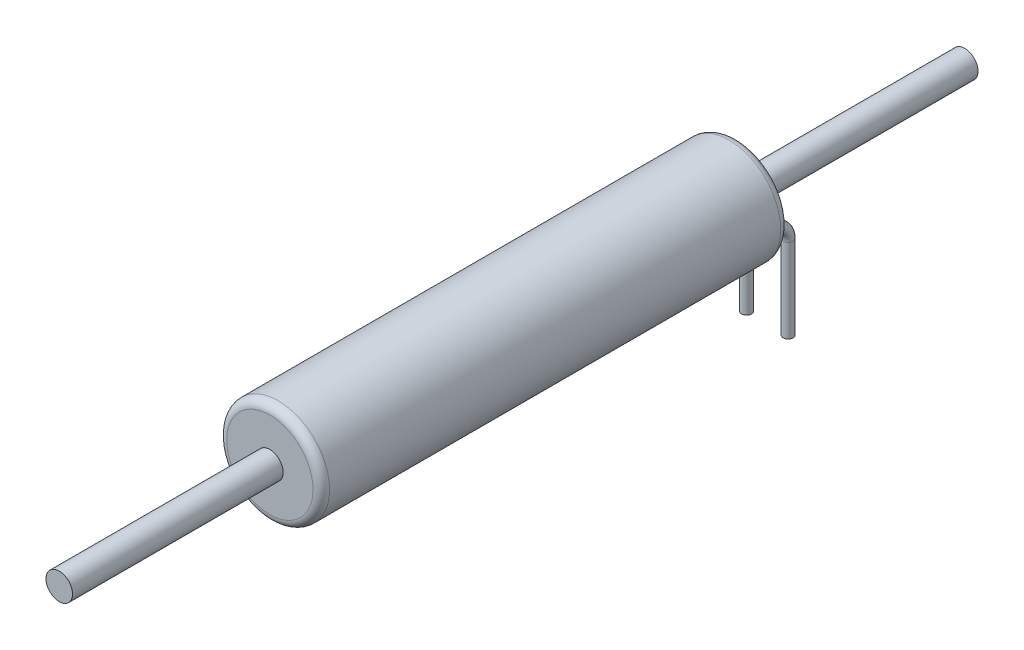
ISO-10303-21;
HEADER;
FILE_DESCRIPTION(('STEP AP214'),'2;1');
FILE_NAME('part.step','',(''),(''),'','','');
FILE_SCHEMA(('AUTOMOTIVE_DESIGN { 1 0 10303 214 1 1 1 1 }'));
ENDSEC;
DATA;
#1=APPLICATION_CONTEXT('core data for automotive mechanical design processes');
#2=APPLICATION_PROTOCOL_DEFINITION('international standard','automotive_design',2000,#1);
#3=PRODUCT_CONTEXT('',#1,'mechanical');
#4=PRODUCT('Part','Part','',(#3));
#5=PRODUCT_RELATED_PRODUCT_CATEGORY('part','',(#4));
#6=PRODUCT_DEFINITION_FORMATION('','',#4);
#7=PRODUCT_DEFINITION_CONTEXT('part definition',#1,'design');
#8=PRODUCT_DEFINITION('design','',#6,#7);
#9=PRODUCT_DEFINITION_SHAPE('','',#8);
#10=(LENGTH_UNIT() NAMED_UNIT(*) SI_UNIT(.MILLI.,.METRE.));
#11=(NAMED_UNIT(*) PLANE_ANGLE_UNIT() SI_UNIT($,.RADIAN.));
#12=(NAMED_UNIT(*) SI_UNIT($,.STERADIAN.) SOLID_ANGLE_UNIT());
#13=UNCERTAINTY_MEASURE_WITH_UNIT(LENGTH_MEASURE(1.E-05),#10,'distance_accuracy_value','');
#14=(GEOMETRIC_REPRESENTATION_CONTEXT(3) GLOBAL_UNCERTAINTY_ASSIGNED_CONTEXT((#13)) GLOBAL_UNIT_ASSIGNED_CONTEXT((#10,
#11,#12)) REPRESENTATION_CONTEXT('',''));
#15=CARTESIAN_POINT('',(0.,0.,0.));
#16=DIRECTION('',(0.,0.,1.));
#17=DIRECTION('',(1.,0.,0.));
#18=AXIS2_PLACEMENT_3D('',#15,#16,#17);
#19=CARTESIAN_POINT('',(0.,0.,0.));
#20=DIRECTION('',(0.,0.,-1.));
#21=DIRECTION('',(0.,-1.,0.));
#22=AXIS2_PLACEMENT_3D('',#19,#20,#21);
#23=CYLINDRICAL_SURFACE('',#22,0.8);
#24=CARTESIAN_POINT('',(0.,0.,0.));
#25=DIRECTION('',(0.,0.,1.));
#26=DIRECTION('',(1.,0.,0.));
#27=AXIS2_PLACEMENT_3D('',#24,#25,#26);
#28=CIRCLE('',#27,0.8);
#29=CARTESIAN_POINT('',(0.8,0.,0.));
#30=VERTEX_POINT('',#29);
#31=EDGE_CURVE('E45',#30,#30,#28,.T.);
#32=ORIENTED_EDGE('',*,*,#31,.F.);
#33=EDGE_LOOP('',(#32));
#34=FACE_BOUND('',#33,.T.);
#35=CARTESIAN_POINT('',(0.,0.,-13.7));
#36=DIRECTION('',(0.,0.,-1.));
#37=DIRECTION('',(-1.,0.,0.));
#38=AXIS2_PLACEMENT_3D('',#35,#36,#37);
#39=CIRCLE('',#38,0.8);
#40=CARTESIAN_POINT('',(-0.8,0.,-13.7));
#41=VERTEX_POINT('',#40);
#42=EDGE_CURVE('E87',#41,#41,#39,.T.);
#43=ORIENTED_EDGE('',*,*,#42,.F.);
#44=EDGE_LOOP('',(#43));
#45=FACE_BOUND('',#44,.T.);
#46=ADVANCED_FACE('F32',(#34,#45),#23,.T.);
#47=CARTESIAN_POINT('',(0.,0.,28.2));
#48=DIRECTION('',(0.,0.,1.));
#49=DIRECTION('',(1.,0.,0.));
#50=AXIS2_PLACEMENT_3D('',#47,#48,#49);
#51=CYLINDRICAL_SURFACE('',#50,0.8);
#52=CARTESIAN_POINT('',(0.,0.,28.2));
#53=DIRECTION('',(0.,0.,-1.));
#54=DIRECTION('',(0.,-1.,0.));
#55=AXIS2_PLACEMENT_3D('',#52,#53,#54);
#56=CIRCLE('',#55,0.8);
#57=CARTESIAN_POINT('',(0.,-0.8,28.2));
#58=VERTEX_POINT('',#57);
#59=EDGE_CURVE('E65',#58,#58,#56,.T.);
#60=ORIENTED_EDGE('',*,*,#59,.F.);
#61=EDGE_LOOP('',(#60));
#62=FACE_BOUND('',#61,.T.);
#63=CARTESIAN_POINT('',(-3.05416169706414E-13,7.63266471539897E-13,40.9));
#64=DIRECTION('',(0.,0.,1.));
#65=DIRECTION('',(1.,0.,0.));
#66=AXIS2_PLACEMENT_3D('',#63,#64,#65);
#67=CIRCLE('',#66,0.8);
#68=CARTESIAN_POINT('',(0.799999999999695,7.63266471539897E-13,40.9));
#69=VERTEX_POINT('',#68);
#70=EDGE_CURVE('E48',#69,#69,#67,.T.);
#71=ORIENTED_EDGE('',*,*,#70,.F.);
#72=EDGE_LOOP('',(#71));
#73=FACE_BOUND('',#72,.T.);
#74=ADVANCED_FACE('F34',(#62,#73),#51,.T.);
#75=CARTESIAN_POINT('',(0.,0.,0.5));
#76=DIRECTION('',(0.,0.,-1.));
#77=DIRECTION('',(0.,-1.,0.));
#78=AXIS2_PLACEMENT_3D('',#75,#76,#77);
#79=TOROIDAL_SURFACE('',#78,2.6,0.5);
#80=CARTESIAN_POINT('',(0.,0.,0.5));
#81=DIRECTION('',(0.,0.,-1.));
#82=DIRECTION('',(0.,-1.,0.));
#83=AXIS2_PLACEMENT_3D('',#80,#81,#82);
#84=CIRCLE('',#83,3.1);
#85=CARTESIAN_POINT('',(0.,-3.1,0.5));
#86=VERTEX_POINT('',#85);
#87=EDGE_CURVE('E10',#86,#86,#84,.T.);
#88=ORIENTED_EDGE('',*,*,#87,.T.);
#89=EDGE_LOOP('',(#88));
#90=FACE_BOUND('',#89,.T.);
#91=CARTESIAN_POINT('',(0.,0.,0.));
#92=DIRECTION('',(0.,0.,1.));
#93=DIRECTION('',(1.,0.,0.));
#94=AXIS2_PLACEMENT_3D('',#91,#92,#93);
#95=CIRCLE('',#94,2.6);
#96=CARTESIAN_POINT('',(2.6,0.,0.));
#97=VERTEX_POINT('',#96);
#98=EDGE_CURVE('E40',#97,#97,#95,.T.);
#99=ORIENTED_EDGE('',*,*,#98,.T.);
#100=EDGE_LOOP('',(#99));
#101=FACE_BOUND('',#100,.T.);
#102=ADVANCED_FACE('F100',(#90,#101),#79,.T.);
#103=CARTESIAN_POINT('',(0.,0.,0.));
#104=DIRECTION('',(0.,0.,1.));
#105=DIRECTION('',(1.,0.,0.));
#106=AXIS2_PLACEMENT_3D('',#103,#104,#105);
#107=CYLINDRICAL_SURFACE('',#106,3.1);
#108=CARTESIAN_POINT('',(0.,0.,27.7));
#109=DIRECTION('',(0.,0.,1.));
#110=DIRECTION('',(1.,0.,0.));
#111=AXIS2_PLACEMENT_3D('',#108,#109,#110);
#112=CIRCLE('',#111,3.1);
#113=CARTESIAN_POINT('',(3.1,0.,27.7));
#114=VERTEX_POINT('',#113);
#115=EDGE_CURVE('E51',#114,#114,#112,.T.);
#116=ORIENTED_EDGE('',*,*,#115,.F.);
#117=EDGE_LOOP('',(#116));
#118=FACE_BOUND('',#117,.T.);
#119=ORIENTED_EDGE('',*,*,#87,.F.);
#120=EDGE_LOOP('',(#119));
#121=FACE_BOUND('',#120,.T.);
#122=ADVANCED_FACE('F114',(#118,#121),#107,.T.);
#123=CARTESIAN_POINT('',(0.,0.,0.));
#124=DIRECTION('',(0.,0.,1.));
#125=DIRECTION('',(1.,0.,0.));
#126=AXIS2_PLACEMENT_3D('',#123,#124,#125);
#127=PLANE('',#126);
#128=ORIENTED_EDGE('',*,*,#31,.T.);
#129=EDGE_LOOP('',(#128));
#130=FACE_BOUND('',#129,.T.);
#131=CARTESIAN_POINT('',(1.25,-1.55,0.));
#132=DIRECTION('',(0.,0.,1.));
#133=DIRECTION('',(1.,0.,0.));
#134=AXIS2_PLACEMENT_3D('',#131,#132,#133);
#135=CIRCLE('',#134,0.3);
#136=CARTESIAN_POINT('',(1.55,-1.55,0.));
#137=VERTEX_POINT('',#136);
#138=EDGE_CURVE('E58',#137,#137,#135,.T.);
#139=ORIENTED_EDGE('',*,*,#138,.T.);
#140=EDGE_LOOP('',(#139));
#141=FACE_BOUND('',#140,.T.);
#142=CARTESIAN_POINT('',(-1.25,-1.55,0.));
#143=DIRECTION('',(0.,0.,1.));
#144=DIRECTION('',(1.,0.,0.));
#145=AXIS2_PLACEMENT_3D('',#142,#143,#144);
#146=CIRCLE('',#145,0.3);
#147=CARTESIAN_POINT('',(-0.95,-1.55,0.));
#148=VERTEX_POINT('',#147);
#149=EDGE_CURVE('E54',#148,#148,#146,.T.);
#150=ORIENTED_EDGE('',*,*,#149,.T.);
#151=EDGE_LOOP('',(#150));
#152=FACE_BOUND('',#151,.T.);
#153=ORIENTED_EDGE('',*,*,#98,.F.);
#154=EDGE_LOOP('',(#153));
#155=FACE_BOUND('',#154,.T.);
#156=ADVANCED_FACE('F117',(#130,#141,#152,#155),#127,.F.);
#157=CARTESIAN_POINT('',(0.,0.,27.7));
#158=DIRECTION('',(0.,0.,1.));
#159=DIRECTION('',(1.,0.,0.));
#160=AXIS2_PLACEMENT_3D('',#157,#158,#159);
#161=TOROIDAL_SURFACE('',#160,2.6,0.5);
#162=ORIENTED_EDGE('',*,*,#115,.T.);
#163=EDGE_LOOP('',(#162));
#164=FACE_BOUND('',#163,.T.);
#165=CARTESIAN_POINT('',(0.,0.,28.2));
#166=DIRECTION('',(0.,0.,-1.));
#167=DIRECTION('',(0.,-1.,0.));
#168=AXIS2_PLACEMENT_3D('',#165,#166,#167);
#169=CIRCLE('',#168,2.6);
#170=CARTESIAN_POINT('',(0.,-2.6,28.2));
#171=VERTEX_POINT('',#170);
#172=EDGE_CURVE('E55',#171,#171,#169,.T.);
#173=ORIENTED_EDGE('',*,*,#172,.T.);
#174=EDGE_LOOP('',(#173));
#175=FACE_BOUND('',#174,.T.);
#176=ADVANCED_FACE('F143',(#164,#175),#161,.T.);
#177=CARTESIAN_POINT('',(0.,0.,28.2));
#178=DIRECTION('',(0.,0.,1.));
#179=DIRECTION('',(1.,0.,0.));
#180=AXIS2_PLACEMENT_3D('',#177,#178,#179);
#181=PLANE('',#180);
#182=ORIENTED_EDGE('',*,*,#59,.T.);
#183=EDGE_LOOP('',(#182));
#184=FACE_BOUND('',#183,.T.);
#185=ORIENTED_EDGE('',*,*,#172,.F.);
#186=EDGE_LOOP('',(#185));
#187=FACE_BOUND('',#186,.T.);
#188=ADVANCED_FACE('F139',(#184,#187),#181,.T.);
#189=CARTESIAN_POINT('',(-1.25,-2.55,-1.8));
#190=DIRECTION('',(0.,1.,0.));
#191=DIRECTION('',(1.,0.,0.));
#192=AXIS2_PLACEMENT_3D('',#189,#190,#191);
#193=CYLINDRICAL_SURFACE('',#192,0.3);
#194=CARTESIAN_POINT('',(-1.25,-7.6,-1.8));
#195=DIRECTION('',(0.,-1.,0.));
#196=DIRECTION('',(0.,0.,-1.));
#197=AXIS2_PLACEMENT_3D('',#194,#195,#196);
#198=CIRCLE('',#197,0.3);
#199=CARTESIAN_POINT('',(-1.25,-7.6,-2.1));
#200=VERTEX_POINT('',#199);
#201=EDGE_CURVE('E69',#200,#200,#198,.T.);
#202=ORIENTED_EDGE('',*,*,#201,.F.);
#203=EDGE_LOOP('',(#202));
#204=FACE_BOUND('',#203,.T.);
#205=CARTESIAN_POINT('',(-1.25,-2.55,-1.8));
#206=DIRECTION('',(0.,-1.,0.));
#207=DIRECTION('',(0.,0.,-1.));
#208=AXIS2_PLACEMENT_3D('',#205,#206,#207);
#209=CIRCLE('',#208,0.3);
#210=CARTESIAN_POINT('',(-1.25,-2.55,-2.1));
#211=VERTEX_POINT('',#210);
#212=EDGE_CURVE('E68',#211,#211,#209,.T.);
#213=ORIENTED_EDGE('',*,*,#212,.T.);
#214=EDGE_LOOP('',(#213));
#215=FACE_BOUND('',#214,.T.);
#216=ADVANCED_FACE('F135',(#204,#215),#193,.T.);
#217=CARTESIAN_POINT('',(-1.25,-2.55,-0.8));
#218=DIRECTION('',(1.,0.,0.));
#219=DIRECTION('',(0.,1.,0.));
#220=AXIS2_PLACEMENT_3D('',#217,#218,#219);
#221=TOROIDAL_SURFACE('',#220,1.,0.3);
#222=CARTESIAN_POINT('',(-1.25,-1.55,-0.8));
#223=DIRECTION('',(0.,0.,-1.));
#224=DIRECTION('',(0.,-1.,0.));
#225=AXIS2_PLACEMENT_3D('',#222,#223,#224);
#226=CIRCLE('',#225,0.3);
#227=CARTESIAN_POINT('',(-1.25,-1.25,-0.8));
#228=VERTEX_POINT('',#227);
#229=EDGE_CURVE('E72',#228,#228,#226,.T.);
#230=CARTESIAN_POINT('',(-1.25,-2.55,-0.8));
#231=DIRECTION('',(1.,0.,0.));
#232=DIRECTION('',(0.,1.,0.));
#233=AXIS2_PLACEMENT_3D('',#230,#231,#232);
#234=CIRCLE('',#233,1.3);
#235=EDGE_CURVE('',#211,#228,#234,.T.);
#236=ORIENTED_EDGE('',*,*,#212,.F.);
#237=ORIENTED_EDGE('',*,*,#229,.T.);
#238=ORIENTED_EDGE('',*,*,#235,.T.);
#239=ORIENTED_EDGE('',*,*,#235,.F.);
#240=EDGE_LOOP('',(#236,#238,#237,#239));
#241=FACE_BOUND('',#240,.T.);
#242=ADVANCED_FACE('F131',(#241),#221,.T.);
#243=CARTESIAN_POINT('',(-1.25,-1.55,0.));
#244=DIRECTION('',(0.,0.,1.));
#245=DIRECTION('',(1.,0.,0.));
#246=AXIS2_PLACEMENT_3D('',#243,#244,#245);
#247=CYLINDRICAL_SURFACE('',#246,0.3);
#248=ORIENTED_EDGE('',*,*,#229,.F.);
#249=EDGE_LOOP('',(#248));
#250=FACE_BOUND('',#249,.T.);
#251=ORIENTED_EDGE('',*,*,#149,.F.);
#252=EDGE_LOOP('',(#251));
#253=FACE_BOUND('',#252,.T.);
#254=ADVANCED_FACE('F121',(#250,#253),#247,.T.);
#255=CARTESIAN_POINT('',(-1.25,-7.6,-1.8));
#256=DIRECTION('',(0.,1.,0.));
#257=DIRECTION('',(0.,0.,1.));
#258=AXIS2_PLACEMENT_3D('',#255,#256,#257);
#259=PLANE('',#258);
#260=ORIENTED_EDGE('',*,*,#201,.T.);
#261=EDGE_LOOP('',(#260));
#262=FACE_BOUND('',#261,.T.);
#263=ADVANCED_FACE('F108',(#262),#259,.F.);
#264=CARTESIAN_POINT('',(1.25,-2.55,-1.8));
#265=DIRECTION('',(0.,-1.,0.));
#266=DIRECTION('',(0.,0.,-1.));
#267=AXIS2_PLACEMENT_3D('',#264,#265,#266);
#268=CYLINDRICAL_SURFACE('',#267,0.3);
#269=CARTESIAN_POINT('',(1.25,-7.6,-1.8));
#270=DIRECTION('',(0.,1.,0.));
#271=DIRECTION('',(1.,0.,0.));
#272=AXIS2_PLACEMENT_3D('',#269,#270,#271);
#273=CIRCLE('',#272,0.3);
#274=CARTESIAN_POINT('',(1.55,-7.6,-1.8));
#275=VERTEX_POINT('',#274);
#276=EDGE_CURVE('E73',#275,#275,#273,.T.);
#277=ORIENTED_EDGE('',*,*,#276,.T.);
#278=EDGE_LOOP('',(#277));
#279=FACE_BOUND('',#278,.T.);
#280=CARTESIAN_POINT('',(1.25,-2.55,-1.8));
#281=DIRECTION('',(0.,1.,0.));
#282=DIRECTION('',(1.,0.,0.));
#283=AXIS2_PLACEMENT_3D('',#280,#281,#282);
#284=CIRCLE('',#283,0.3);
#285=CARTESIAN_POINT('',(1.25,-2.55,-2.1));
#286=VERTEX_POINT('',#285);
#287=EDGE_CURVE('E79',#286,#286,#284,.T.);
#288=ORIENTED_EDGE('',*,*,#287,.F.);
#289=EDGE_LOOP('',(#288));
#290=FACE_BOUND('',#289,.T.);
#291=ADVANCED_FACE('F104',(#279,#290),#268,.T.);
#292=CARTESIAN_POINT('',(1.25,-2.55,-0.8));
#293=DIRECTION('',(-1.,0.,0.));
#294=DIRECTION('',(0.,0.,1.));
#295=AXIS2_PLACEMENT_3D('',#292,#293,#294);
#296=TOROIDAL_SURFACE('',#295,1.,0.3);
#297=CARTESIAN_POINT('',(1.25,-1.55,-0.8));
#298=DIRECTION('',(0.,0.,1.));
#299=DIRECTION('',(1.,0.,0.));
#300=AXIS2_PLACEMENT_3D('',#297,#298,#299);
#301=CIRCLE('',#300,0.3);
#302=CARTESIAN_POINT('',(1.25,-1.25,-0.8));
#303=VERTEX_POINT('',#302);
#304=EDGE_CURVE('E36',#303,#303,#301,.T.);
#305=CARTESIAN_POINT('',(1.25,-2.55,-0.8));
#306=DIRECTION('',(-1.,0.,0.));
#307=DIRECTION('',(0.,0.,1.));
#308=AXIS2_PLACEMENT_3D('',#305,#306,#307);
#309=CIRCLE('',#308,1.3);
#310=EDGE_CURVE('',#303,#286,#309,.T.);
#311=ORIENTED_EDGE('',*,*,#304,.F.);
#312=ORIENTED_EDGE('',*,*,#287,.T.);
#313=ORIENTED_EDGE('',*,*,#310,.T.);
#314=ORIENTED_EDGE('',*,*,#310,.F.);
#315=EDGE_LOOP('',(#311,#313,#312,#314));
#316=FACE_BOUND('',#315,.T.);
#317=ADVANCED_FACE('F107',(#316),#296,.T.);
#318=CARTESIAN_POINT('',(1.25,-1.55,0.));
#319=DIRECTION('',(0.,0.,-1.));
#320=DIRECTION('',(0.,-1.,0.));
#321=AXIS2_PLACEMENT_3D('',#318,#319,#320);
#322=CYLINDRICAL_SURFACE('',#321,0.3);
#323=ORIENTED_EDGE('',*,*,#304,.T.);
#324=EDGE_LOOP('',(#323));
#325=FACE_BOUND('',#324,.T.);
#326=ORIENTED_EDGE('',*,*,#138,.F.);
#327=EDGE_LOOP('',(#326));
#328=FACE_BOUND('',#327,.T.);
#329=ADVANCED_FACE('F110',(#325,#328),#322,.T.);
#330=CARTESIAN_POINT('',(1.25,-7.6,-1.8));
#331=DIRECTION('',(0.,1.,0.));
#332=DIRECTION('',(0.,0.,1.));
#333=AXIS2_PLACEMENT_3D('',#330,#331,#332);
#334=PLANE('',#333);
#335=ORIENTED_EDGE('',*,*,#276,.F.);
#336=EDGE_LOOP('',(#335));
#337=FACE_BOUND('',#336,.T.);
#338=ADVANCED_FACE('F113',(#337),#334,.F.);
#339=CARTESIAN_POINT('',(-3.05416169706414E-13,7.63266471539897E-13,40.9));
#340=DIRECTION('',(0.,0.,1.));
#341=DIRECTION('',(1.,0.,0.));
#342=AXIS2_PLACEMENT_3D('',#339,#340,#341);
#343=PLANE('',#342);
#344=ORIENTED_EDGE('',*,*,#70,.T.);
#345=EDGE_LOOP('',(#344));
#346=FACE_BOUND('',#345,.T.);
#347=ADVANCED_FACE('F125',(#346),#343,.T.);
#348=CARTESIAN_POINT('',(0.,0.,-13.7));
#349=DIRECTION('',(0.,0.,-1.));
#350=DIRECTION('',(-1.,0.,0.));
#351=AXIS2_PLACEMENT_3D('',#348,#349,#350);
#352=PLANE('',#351);
#353=ORIENTED_EDGE('',*,*,#42,.T.);
#354=EDGE_LOOP('',(#353));
#355=FACE_BOUND('',#354,.T.);
#356=ADVANCED_FACE('F93',(#355),#352,.T.);
#357=CLOSED_SHELL('',(#46,#74,#102,#122,#156,#176,#188,#216,#242,#254,#263,#291,#317,#329,#338,
#347,#356));
#358=MANIFOLD_SOLID_BREP('B2',#357);
#359=ADVANCED_BREP_SHAPE_REPRESENTATION('',(#18,#358),#14);
#360=SHAPE_DEFINITION_REPRESENTATION(#9,#359);
ENDSEC;
END-ISO-10303-21;
